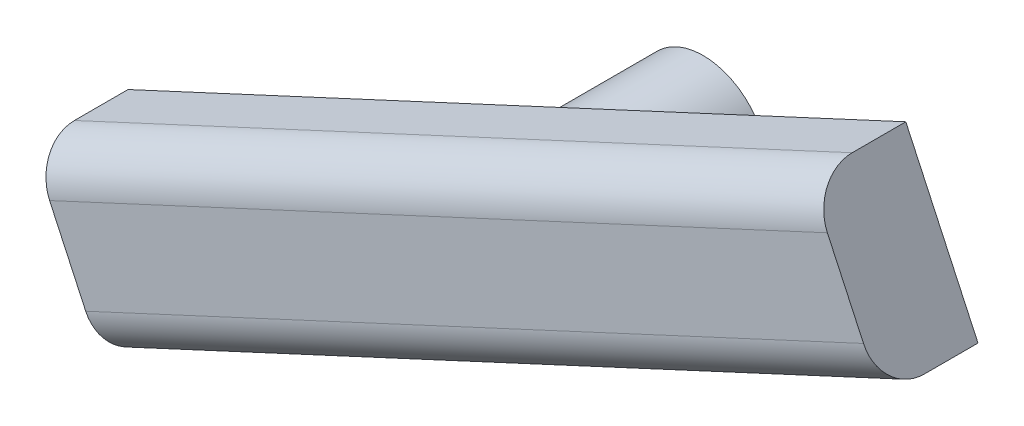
ISO-10303-21;
HEADER;
FILE_DESCRIPTION(('STEP AP214'),'2;1');
FILE_NAME('part.step','',(''),(''),'','','');
FILE_SCHEMA(('AUTOMOTIVE_DESIGN { 1 0 10303 214 1 1 1 1 }'));
ENDSEC;
DATA;
#1=APPLICATION_CONTEXT('core data for automotive mechanical design processes');
#2=APPLICATION_PROTOCOL_DEFINITION('international standard','automotive_design',2000,#1);
#3=PRODUCT_CONTEXT('',#1,'mechanical');
#4=PRODUCT('Part','Part','',(#3));
#5=PRODUCT_RELATED_PRODUCT_CATEGORY('part','',(#4));
#6=PRODUCT_DEFINITION_FORMATION('','',#4);
#7=PRODUCT_DEFINITION_CONTEXT('part definition',#1,'design');
#8=PRODUCT_DEFINITION('design','',#6,#7);
#9=PRODUCT_DEFINITION_SHAPE('','',#8);
#10=(LENGTH_UNIT() NAMED_UNIT(*) SI_UNIT(.MILLI.,.METRE.));
#11=(NAMED_UNIT(*) PLANE_ANGLE_UNIT() SI_UNIT($,.RADIAN.));
#12=(NAMED_UNIT(*) SI_UNIT($,.STERADIAN.) SOLID_ANGLE_UNIT());
#13=UNCERTAINTY_MEASURE_WITH_UNIT(LENGTH_MEASURE(1.E-05),#10,'distance_accuracy_value','');
#14=(GEOMETRIC_REPRESENTATION_CONTEXT(3) GLOBAL_UNCERTAINTY_ASSIGNED_CONTEXT((#13)) GLOBAL_UNIT_ASSIGNED_CONTEXT((#10,
#11,#12)) REPRESENTATION_CONTEXT('',''));
#15=CARTESIAN_POINT('',(0.,0.,0.));
#16=DIRECTION('',(0.,0.,1.));
#17=DIRECTION('',(1.,0.,0.));
#18=AXIS2_PLACEMENT_3D('',#15,#16,#17);
#19=CARTESIAN_POINT('',(455.341566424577,345.362620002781,-22.));
#20=DIRECTION('',(0.,0.,1.));
#21=DIRECTION('',(1.,0.,0.));
#22=AXIS2_PLACEMENT_3D('',#19,#20,#21);
#23=PLANE('',#22);
#24=CARTESIAN_POINT('',(455.341566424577,345.362620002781,-22.));
#25=DIRECTION('',(0.,0.,1.));
#26=DIRECTION('',(1.,0.,0.));
#27=AXIS2_PLACEMENT_3D('',#24,#25,#26);
#28=CIRCLE('',#27,3.);
#29=CARTESIAN_POINT('',(458.341566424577,345.362620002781,-22.));
#30=VERTEX_POINT('',#29);
#31=EDGE_CURVE('E101',#30,#30,#28,.T.);
#32=ORIENTED_EDGE('',*,*,#31,.F.);
#33=EDGE_LOOP('',(#32));
#34=FACE_BOUND('',#33,.T.);
#35=ADVANCED_FACE('F40',(#34),#23,.F.);
#36=CARTESIAN_POINT('',(455.341566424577,345.362620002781,-22.));
#37=DIRECTION('',(0.,0.,1.));
#38=DIRECTION('',(1.,0.,0.));
#39=AXIS2_PLACEMENT_3D('',#36,#37,#38);
#40=CYLINDRICAL_SURFACE('',#39,3.);
#41=CARTESIAN_POINT('',(455.341566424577,345.362620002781,-15.));
#42=DIRECTION('',(0.,0.,1.));
#43=DIRECTION('',(1.,0.,0.));
#44=AXIS2_PLACEMENT_3D('',#41,#42,#43);
#45=CIRCLE('',#44,3.);
#46=CARTESIAN_POINT('',(458.341566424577,345.362620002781,-15.));
#47=VERTEX_POINT('',#46);
#48=EDGE_CURVE('E130',#47,#47,#45,.T.);
#49=ORIENTED_EDGE('',*,*,#48,.F.);
#50=EDGE_LOOP('',(#49));
#51=FACE_BOUND('',#50,.T.);
#52=ORIENTED_EDGE('',*,*,#31,.T.);
#53=EDGE_LOOP('',(#52));
#54=FACE_BOUND('',#53,.T.);
#55=ADVANCED_FACE('F162',(#51,#54),#40,.T.);
#56=CARTESIAN_POINT('',(475.166946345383,350.153685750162,-10.5));
#57=DIRECTION('',(-0.420968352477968,0.907075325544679,0.));
#58=DIRECTION('',(-0.907075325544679,-0.420968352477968,0.));
#59=AXIS2_PLACEMENT_3D('',#56,#57,#58);
#60=PLANE('',#59);
#61=DIRECTION('',(0.,0.,-1.));
#62=VECTOR('',#61,1.);
#63=CARTESIAN_POINT('',(475.166946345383,350.153685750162,-10.5));
#64=LINE('',#63,#62);
#65=CARTESIAN_POINT('',(475.166946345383,350.153685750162,-12.5));
#66=VERTEX_POINT('',#65);
#67=CARTESIAN_POINT('',(475.166946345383,350.153685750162,-15.));
#68=VERTEX_POINT('',#67);
#69=EDGE_CURVE('E92',#66,#68,#64,.T.);
#70=ORIENTED_EDGE('',*,*,#69,.F.);
#71=DIRECTION('',(0.907075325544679,0.420968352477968,0.));
#72=VECTOR('',#71,1.);
#73=CARTESIAN_POINT('',(475.166946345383,350.153685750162,-12.5));
#74=LINE('',#73,#72);
#75=CARTESIAN_POINT('',(438.883933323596,333.314951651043,-12.5));
#76=VERTEX_POINT('',#75);
#77=EDGE_CURVE('E63',#66,#76,#74,.F.);
#78=ORIENTED_EDGE('',*,*,#77,.T.);
#79=DIRECTION('',(0.,0.,-1.));
#80=VECTOR('',#79,1.);
#81=CARTESIAN_POINT('',(438.883933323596,333.314951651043,-10.5));
#82=LINE('',#81,#80);
#83=CARTESIAN_POINT('',(438.883933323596,333.314951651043,-15.));
#84=VERTEX_POINT('',#83);
#85=EDGE_CURVE('E113',#76,#84,#82,.T.);
#86=ORIENTED_EDGE('',*,*,#85,.T.);
#87=DIRECTION('',(0.907075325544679,0.420968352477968,0.));
#88=VECTOR('',#87,1.);
#89=CARTESIAN_POINT('',(475.166946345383,350.153685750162,-15.));
#90=LINE('',#89,#88);
#91=EDGE_CURVE('E108',#84,#68,#90,.T.);
#92=ORIENTED_EDGE('',*,*,#91,.T.);
#93=EDGE_LOOP('',(#70,#78,#86,#92));
#94=FACE_BOUND('',#93,.T.);
#95=ADVANCED_FACE('F112',(#94),#60,.F.);
#96=CARTESIAN_POINT('',(471.799199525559,357.410288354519,-10.5));
#97=DIRECTION('',(-0.907075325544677,-0.420968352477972,0.));
#98=DIRECTION('',(0.420968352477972,-0.907075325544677,0.));
#99=AXIS2_PLACEMENT_3D('',#96,#97,#98);
#100=PLANE('',#99);
#101=DIRECTION('',(-0.420968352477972,0.907075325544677,0.));
#102=VECTOR('',#101,1.);
#103=CARTESIAN_POINT('',(471.799199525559,357.410288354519,-10.5));
#104=LINE('',#103,#102);
#105=CARTESIAN_POINT('',(474.325009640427,351.967836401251,-10.5));
#106=VERTEX_POINT('',#105);
#107=CARTESIAN_POINT('',(472.641136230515,355.59613770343,-10.5));
#108=VERTEX_POINT('',#107);
#109=EDGE_CURVE('E123',#106,#108,#104,.T.);
#110=ORIENTED_EDGE('',*,*,#109,.F.);
#111=CARTESIAN_POINT('',(474.325009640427,351.967836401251,-12.5));
#112=DIRECTION('',(-0.907075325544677,-0.420968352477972,0.));
#113=DIRECTION('',(0.420968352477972,-0.907075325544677,0.));
#114=AXIS2_PLACEMENT_3D('',#111,#112,#113);
#115=CIRCLE('',#114,2.);
#116=EDGE_CURVE('E99',#106,#66,#115,.F.);
#117=ORIENTED_EDGE('',*,*,#116,.T.);
#118=ORIENTED_EDGE('',*,*,#69,.T.);
#119=DIRECTION('',(-0.420968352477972,0.907075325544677,0.));
#120=VECTOR('',#119,1.);
#121=CARTESIAN_POINT('',(471.799199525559,357.410288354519,-15.));
#122=LINE('',#121,#120);
#123=CARTESIAN_POINT('',(471.799199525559,357.410288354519,-15.));
#124=VERTEX_POINT('',#123);
#125=EDGE_CURVE('E97',#68,#124,#122,.T.);
#126=ORIENTED_EDGE('',*,*,#125,.T.);
#127=DIRECTION('',(0.,0.,-1.));
#128=VECTOR('',#127,1.);
#129=CARTESIAN_POINT('',(471.799199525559,357.410288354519,-10.5));
#130=LINE('',#129,#128);
#131=CARTESIAN_POINT('',(471.799199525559,357.410288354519,-12.5));
#132=VERTEX_POINT('',#131);
#133=EDGE_CURVE('E102',#132,#124,#130,.T.);
#134=ORIENTED_EDGE('',*,*,#133,.F.);
#135=CARTESIAN_POINT('',(472.641136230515,355.59613770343,-12.5));
#136=DIRECTION('',(-0.907075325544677,-0.420968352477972,0.));
#137=DIRECTION('',(0.420968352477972,-0.907075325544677,0.));
#138=AXIS2_PLACEMENT_3D('',#135,#136,#137);
#139=CIRCLE('',#138,2.);
#140=EDGE_CURVE('E139',#132,#108,#139,.F.);
#141=ORIENTED_EDGE('',*,*,#140,.T.);
#142=EDGE_LOOP('',(#110,#117,#118,#126,#134,#141));
#143=FACE_BOUND('',#142,.T.);
#144=ADVANCED_FACE('F95',(#143),#100,.F.);
#145=CARTESIAN_POINT('',(435.516186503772,340.5715542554,-10.5));
#146=DIRECTION('',(0.420968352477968,-0.907075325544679,0.));
#147=DIRECTION('',(0.907075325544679,0.420968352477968,0.));
#148=AXIS2_PLACEMENT_3D('',#145,#146,#147);
#149=PLANE('',#148);
#150=DIRECTION('',(0.,0.,-1.));
#151=VECTOR('',#150,1.);
#152=CARTESIAN_POINT('',(435.516186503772,340.5715542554,-10.5));
#153=LINE('',#152,#151);
#154=CARTESIAN_POINT('',(435.516186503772,340.5715542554,-12.5));
#155=VERTEX_POINT('',#154);
#156=CARTESIAN_POINT('',(435.516186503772,340.5715542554,-15.));
#157=VERTEX_POINT('',#156);
#158=EDGE_CURVE('E125',#155,#157,#153,.T.);
#159=ORIENTED_EDGE('',*,*,#158,.F.);
#160=DIRECTION('',(-0.907075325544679,-0.420968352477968,0.));
#161=VECTOR('',#160,1.);
#162=CARTESIAN_POINT('',(435.516186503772,340.5715542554,-12.5));
#163=LINE('',#162,#161);
#164=EDGE_CURVE('E12',#155,#132,#163,.F.);
#165=ORIENTED_EDGE('',*,*,#164,.T.);
#166=ORIENTED_EDGE('',*,*,#133,.T.);
#167=DIRECTION('',(-0.907075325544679,-0.420968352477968,0.));
#168=VECTOR('',#167,1.);
#169=CARTESIAN_POINT('',(435.516186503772,340.5715542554,-15.));
#170=LINE('',#169,#168);
#171=EDGE_CURVE('E110',#124,#157,#170,.T.);
#172=ORIENTED_EDGE('',*,*,#171,.T.);
#173=EDGE_LOOP('',(#159,#165,#166,#172));
#174=FACE_BOUND('',#173,.T.);
#175=ADVANCED_FACE('F177',(#174),#149,.F.);
#176=CARTESIAN_POINT('',(438.883933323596,333.314951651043,-10.5));
#177=DIRECTION('',(0.907075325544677,0.420968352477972,0.));
#178=DIRECTION('',(-0.420968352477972,0.907075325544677,0.));
#179=AXIS2_PLACEMENT_3D('',#176,#177,#178);
#180=PLANE('',#179);
#181=ORIENTED_EDGE('',*,*,#85,.F.);
#182=CARTESIAN_POINT('',(438.04199661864,335.129102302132,-12.5));
#183=DIRECTION('',(0.907075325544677,0.420968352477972,0.));
#184=DIRECTION('',(-0.420968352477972,0.907075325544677,0.));
#185=AXIS2_PLACEMENT_3D('',#182,#183,#184);
#186=CIRCLE('',#185,2.);
#187=CARTESIAN_POINT('',(438.04199661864,335.129102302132,-10.5));
#188=VERTEX_POINT('',#187);
#189=EDGE_CURVE('E48',#76,#188,#186,.F.);
#190=ORIENTED_EDGE('',*,*,#189,.T.);
#191=DIRECTION('',(0.420968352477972,-0.907075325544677,0.));
#192=VECTOR('',#191,1.);
#193=CARTESIAN_POINT('',(438.883933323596,333.314951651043,-10.5));
#194=LINE('',#193,#192);
#195=CARTESIAN_POINT('',(436.358123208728,338.757403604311,-10.5));
#196=VERTEX_POINT('',#195);
#197=EDGE_CURVE('E117',#196,#188,#194,.T.);
#198=ORIENTED_EDGE('',*,*,#197,.F.);
#199=CARTESIAN_POINT('',(436.358123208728,338.757403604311,-12.5));
#200=DIRECTION('',(0.907075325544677,0.420968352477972,0.));
#201=DIRECTION('',(-0.420968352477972,0.907075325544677,0.));
#202=AXIS2_PLACEMENT_3D('',#199,#200,#201);
#203=CIRCLE('',#202,2.);
#204=EDGE_CURVE('E55',#196,#155,#203,.F.);
#205=ORIENTED_EDGE('',*,*,#204,.T.);
#206=ORIENTED_EDGE('',*,*,#158,.T.);
#207=DIRECTION('',(0.420968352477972,-0.907075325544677,0.));
#208=VECTOR('',#207,1.);
#209=CARTESIAN_POINT('',(438.883933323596,333.314951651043,-15.));
#210=LINE('',#209,#208);
#211=EDGE_CURVE('E121',#157,#84,#210,.T.);
#212=ORIENTED_EDGE('',*,*,#211,.T.);
#213=EDGE_LOOP('',(#181,#190,#198,#205,#206,#212));
#214=FACE_BOUND('',#213,.T.);
#215=ADVANCED_FACE('F145',(#214),#180,.F.);
#216=CARTESIAN_POINT('',(0.,0.,-10.5));
#217=DIRECTION('',(0.,0.,-1.));
#218=DIRECTION('',(-1.,0.,0.));
#219=AXIS2_PLACEMENT_3D('',#216,#217,#218);
#220=PLANE('',#219);
#221=ORIENTED_EDGE('',*,*,#197,.T.);
#222=DIRECTION('',(0.907075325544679,0.420968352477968,0.));
#223=VECTOR('',#222,1.);
#224=CARTESIAN_POINT('',(-50.3417201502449,108.473076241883,-10.5));
#225=LINE('',#224,#223);
#226=EDGE_CURVE('E136',#188,#106,#225,.T.);
#227=ORIENTED_EDGE('',*,*,#226,.T.);
#228=ORIENTED_EDGE('',*,*,#109,.T.);
#229=DIRECTION('',(-0.907075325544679,-0.420968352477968,0.));
#230=VECTOR('',#229,1.);
#231=CARTESIAN_POINT('',(-52.0255935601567,112.101377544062,-10.5));
#232=LINE('',#231,#230);
#233=EDGE_CURVE('E133',#108,#196,#232,.T.);
#234=ORIENTED_EDGE('',*,*,#233,.T.);
#235=EDGE_LOOP('',(#221,#227,#228,#234));
#236=FACE_BOUND('',#235,.T.);
#237=ADVANCED_FACE('F149',(#236),#220,.F.);
#238=CARTESIAN_POINT('',(0.,0.,-15.));
#239=DIRECTION('',(0.,0.,-1.));
#240=DIRECTION('',(-1.,0.,0.));
#241=AXIS2_PLACEMENT_3D('',#238,#239,#240);
#242=PLANE('',#241);
#243=ORIENTED_EDGE('',*,*,#48,.T.);
#244=EDGE_LOOP('',(#243));
#245=FACE_BOUND('',#244,.T.);
#246=ORIENTED_EDGE('',*,*,#91,.F.);
#247=ORIENTED_EDGE('',*,*,#211,.F.);
#248=ORIENTED_EDGE('',*,*,#171,.F.);
#249=ORIENTED_EDGE('',*,*,#125,.F.);
#250=EDGE_LOOP('',(#246,#247,#248,#249));
#251=FACE_BOUND('',#250,.T.);
#252=ADVANCED_FACE('F106',(#245,#251),#242,.T.);
#253=CARTESIAN_POINT('',(-50.3417201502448,108.473076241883,-12.5));
#254=DIRECTION('',(0.907075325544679,0.420968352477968,0.));
#255=DIRECTION('',(-0.420968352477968,0.907075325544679,0.));
#256=AXIS2_PLACEMENT_3D('',#253,#254,#255);
#257=CYLINDRICAL_SURFACE('',#256,2.);
#258=ORIENTED_EDGE('',*,*,#189,.F.);
#259=ORIENTED_EDGE('',*,*,#77,.F.);
#260=ORIENTED_EDGE('',*,*,#116,.F.);
#261=ORIENTED_EDGE('',*,*,#226,.F.);
#262=EDGE_LOOP('',(#258,#259,#260,#261));
#263=FACE_BOUND('',#262,.T.);
#264=ADVANCED_FACE('F152',(#263),#257,.T.);
#265=CARTESIAN_POINT('',(-52.0255935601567,112.101377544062,-12.5));
#266=DIRECTION('',(-0.907075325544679,-0.420968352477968,0.));
#267=DIRECTION('',(0.420968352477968,-0.907075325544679,0.));
#268=AXIS2_PLACEMENT_3D('',#265,#266,#267);
#269=CYLINDRICAL_SURFACE('',#268,2.);
#270=ORIENTED_EDGE('',*,*,#140,.F.);
#271=ORIENTED_EDGE('',*,*,#164,.F.);
#272=ORIENTED_EDGE('',*,*,#204,.F.);
#273=ORIENTED_EDGE('',*,*,#233,.F.);
#274=EDGE_LOOP('',(#270,#271,#272,#273));
#275=FACE_BOUND('',#274,.T.);
#276=ADVANCED_FACE('F42',(#275),#269,.T.);
#277=CLOSED_SHELL('',(#35,#55,#95,#144,#175,#215,#237,#252,#264,#276));
#278=MANIFOLD_SOLID_BREP('B2',#277);
#279=ADVANCED_BREP_SHAPE_REPRESENTATION('',(#18,#278),#14);
#280=SHAPE_DEFINITION_REPRESENTATION(#9,#279);
ENDSEC;
END-ISO-10303-21;
